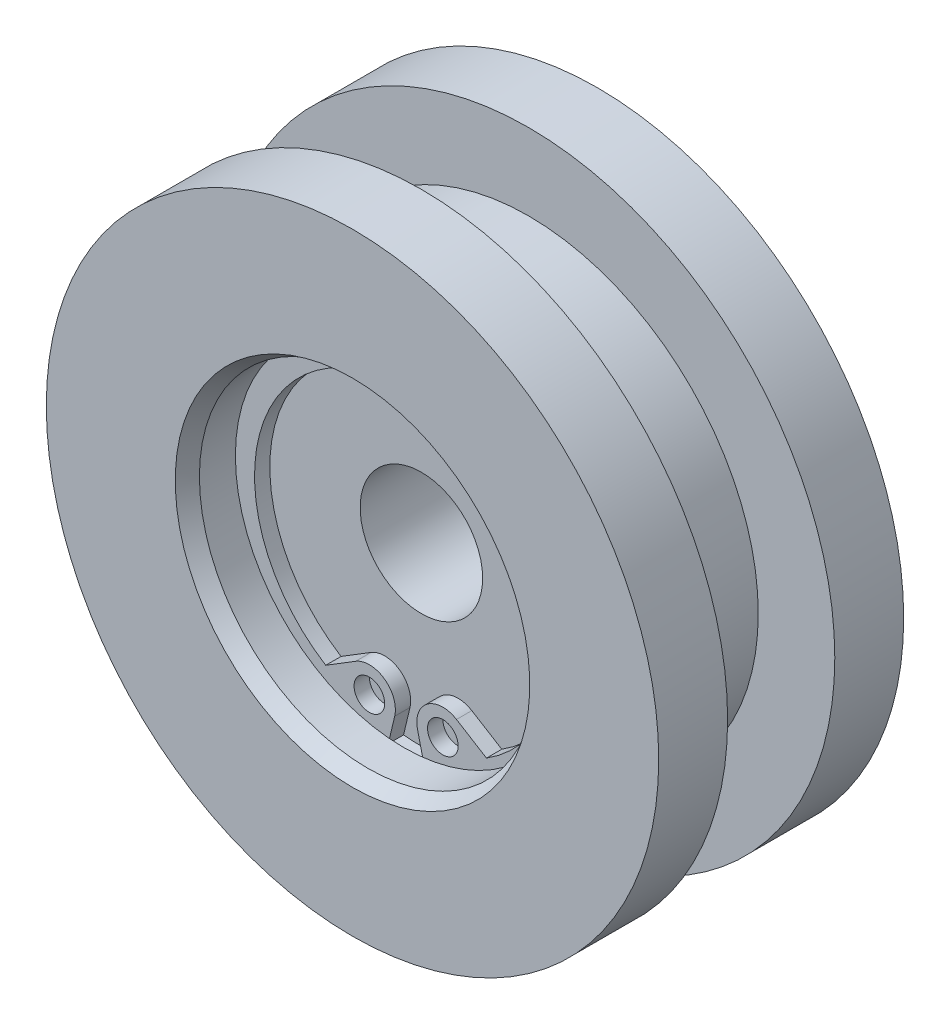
ISO-10303-21;
HEADER;
FILE_DESCRIPTION(('STEP AP214'),'2;1');
FILE_NAME('part.step','',(''),(''),'','','');
FILE_SCHEMA(('AUTOMOTIVE_DESIGN { 1 0 10303 214 1 1 1 1 }'));
ENDSEC;
DATA;
#1=APPLICATION_CONTEXT('core data for automotive mechanical design processes');
#2=APPLICATION_PROTOCOL_DEFINITION('international standard','automotive_design',2000,#1);
#3=PRODUCT_CONTEXT('',#1,'mechanical');
#4=PRODUCT('Part','Part','',(#3));
#5=PRODUCT_RELATED_PRODUCT_CATEGORY('part','',(#4));
#6=PRODUCT_DEFINITION_FORMATION('','',#4);
#7=PRODUCT_DEFINITION_CONTEXT('part definition',#1,'design');
#8=PRODUCT_DEFINITION('design','',#6,#7);
#9=PRODUCT_DEFINITION_SHAPE('','',#8);
#10=(LENGTH_UNIT() NAMED_UNIT(*) SI_UNIT(.MILLI.,.METRE.));
#11=(NAMED_UNIT(*) PLANE_ANGLE_UNIT() SI_UNIT($,.RADIAN.));
#12=(NAMED_UNIT(*) SI_UNIT($,.STERADIAN.) SOLID_ANGLE_UNIT());
#13=UNCERTAINTY_MEASURE_WITH_UNIT(LENGTH_MEASURE(1.E-05),#10,'distance_accuracy_value','');
#14=(GEOMETRIC_REPRESENTATION_CONTEXT(3) GLOBAL_UNCERTAINTY_ASSIGNED_CONTEXT((#13)) GLOBAL_UNIT_ASSIGNED_CONTEXT((#10,
#11,#12)) REPRESENTATION_CONTEXT('',''));
#15=CARTESIAN_POINT('',(0.,0.,0.));
#16=DIRECTION('',(0.,0.,1.));
#17=DIRECTION('',(1.,0.,0.));
#18=AXIS2_PLACEMENT_3D('',#15,#16,#17);
#19=CARTESIAN_POINT('',(0.,0.,-3.5));
#20=DIRECTION('',(0.,0.,1.));
#21=DIRECTION('',(1.,0.,0.));
#22=AXIS2_PLACEMENT_3D('',#19,#20,#21);
#23=CYLINDRICAL_SURFACE('',#22,15.);
#24=CARTESIAN_POINT('',(0.,0.,3.5));
#25=DIRECTION('',(0.,0.,1.));
#26=DIRECTION('',(1.,0.,0.));
#27=AXIS2_PLACEMENT_3D('',#24,#25,#26);
#28=CIRCLE('',#27,15.);
#29=CARTESIAN_POINT('',(15.,0.,3.5));
#30=VERTEX_POINT('',#29);
#31=EDGE_CURVE('E190',#30,#30,#28,.F.);
#32=ORIENTED_EDGE('',*,*,#31,.T.);
#33=EDGE_LOOP('',(#32));
#34=FACE_BOUND('',#33,.T.);
#35=CARTESIAN_POINT('',(0.,0.,-3.5));
#36=DIRECTION('',(0.,0.,1.));
#37=DIRECTION('',(1.,0.,0.));
#38=AXIS2_PLACEMENT_3D('',#35,#36,#37);
#39=CIRCLE('',#38,15.);
#40=CARTESIAN_POINT('',(15.,0.,-3.5));
#41=VERTEX_POINT('',#40);
#42=EDGE_CURVE('E132',#41,#41,#39,.T.);
#43=ORIENTED_EDGE('',*,*,#42,.T.);
#44=EDGE_LOOP('',(#43));
#45=FACE_BOUND('',#44,.T.);
#46=ADVANCED_FACE('F14',(#34,#45),#23,.T.);
#47=CARTESIAN_POINT('',(20.24,-20.309645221,-3.5));
#48=DIRECTION('',(0.,0.,-1.));
#49=DIRECTION('',(-1.,0.,0.));
#50=AXIS2_PLACEMENT_3D('',#47,#48,#49);
#51=PLANE('',#50);
#52=ORIENTED_EDGE('',*,*,#42,.F.);
#53=EDGE_LOOP('',(#52));
#54=FACE_BOUND('',#53,.T.);
#55=CARTESIAN_POINT('',(0.,0.,-3.5));
#56=DIRECTION('',(0.,0.,1.));
#57=DIRECTION('',(1.,0.,0.));
#58=AXIS2_PLACEMENT_3D('',#55,#56,#57);
#59=CIRCLE('',#58,20.);
#60=CARTESIAN_POINT('',(20.,0.,-3.5));
#61=VERTEX_POINT('',#60);
#62=EDGE_CURVE('E193',#61,#61,#59,.F.);
#63=ORIENTED_EDGE('',*,*,#62,.F.);
#64=EDGE_LOOP('',(#63));
#65=FACE_BOUND('',#64,.T.);
#66=ADVANCED_FACE('F249',(#54,#65),#51,.F.);
#67=CARTESIAN_POINT('',(-20.24,-20.309645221,3.5));
#68=DIRECTION('',(0.,0.,1.));
#69=DIRECTION('',(1.,0.,0.));
#70=AXIS2_PLACEMENT_3D('',#67,#68,#69);
#71=PLANE('',#70);
#72=ORIENTED_EDGE('',*,*,#31,.F.);
#73=EDGE_LOOP('',(#72));
#74=FACE_BOUND('',#73,.T.);
#75=CARTESIAN_POINT('',(0.,0.,3.5));
#76=DIRECTION('',(0.,0.,1.));
#77=DIRECTION('',(1.,0.,0.));
#78=AXIS2_PLACEMENT_3D('',#75,#76,#77);
#79=CIRCLE('',#78,20.);
#80=CARTESIAN_POINT('',(20.,0.,3.5));
#81=VERTEX_POINT('',#80);
#82=EDGE_CURVE('E196',#81,#81,#79,.T.);
#83=ORIENTED_EDGE('',*,*,#82,.F.);
#84=EDGE_LOOP('',(#83));
#85=FACE_BOUND('',#84,.T.);
#86=ADVANCED_FACE('F254',(#74,#85),#71,.F.);
#87=CARTESIAN_POINT('',(0.,0.,-8.));
#88=DIRECTION('',(0.,0.,1.));
#89=DIRECTION('',(1.,0.,0.));
#90=AXIS2_PLACEMENT_3D('',#87,#88,#89);
#91=CYLINDRICAL_SURFACE('',#90,20.);
#92=ORIENTED_EDGE('',*,*,#62,.T.);
#93=EDGE_LOOP('',(#92));
#94=FACE_BOUND('',#93,.T.);
#95=CARTESIAN_POINT('',(0.,0.,-8.));
#96=DIRECTION('',(0.,0.,1.));
#97=DIRECTION('',(1.,0.,0.));
#98=AXIS2_PLACEMENT_3D('',#95,#96,#97);
#99=CIRCLE('',#98,20.);
#100=CARTESIAN_POINT('',(20.,0.,-8.));
#101=VERTEX_POINT('',#100);
#102=EDGE_CURVE('E199',#101,#101,#99,.T.);
#103=ORIENTED_EDGE('',*,*,#102,.T.);
#104=EDGE_LOOP('',(#103));
#105=FACE_BOUND('',#104,.T.);
#106=ADVANCED_FACE('F259',(#94,#105),#91,.T.);
#107=CARTESIAN_POINT('',(0.,0.,3.5));
#108=DIRECTION('',(0.,0.,1.));
#109=DIRECTION('',(1.,0.,0.));
#110=AXIS2_PLACEMENT_3D('',#107,#108,#109);
#111=CYLINDRICAL_SURFACE('',#110,20.);
#112=CARTESIAN_POINT('',(0.,0.,8.));
#113=DIRECTION('',(0.,0.,1.));
#114=DIRECTION('',(1.,0.,0.));
#115=AXIS2_PLACEMENT_3D('',#112,#113,#114);
#116=CIRCLE('',#115,20.);
#117=CARTESIAN_POINT('',(20.,0.,8.));
#118=VERTEX_POINT('',#117);
#119=EDGE_CURVE('E202',#118,#118,#116,.F.);
#120=ORIENTED_EDGE('',*,*,#119,.T.);
#121=EDGE_LOOP('',(#120));
#122=FACE_BOUND('',#121,.T.);
#123=ORIENTED_EDGE('',*,*,#82,.T.);
#124=EDGE_LOOP('',(#123));
#125=FACE_BOUND('',#124,.T.);
#126=ADVANCED_FACE('F262',(#122,#125),#111,.T.);
#127=CARTESIAN_POINT('',(-20.24,-20.309645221,-8.));
#128=DIRECTION('',(0.,0.,1.));
#129=DIRECTION('',(1.,0.,0.));
#130=AXIS2_PLACEMENT_3D('',#127,#128,#129);
#131=PLANE('',#130);
#132=CARTESIAN_POINT('',(0.,0.,-8.));
#133=DIRECTION('',(0.,0.,1.));
#134=DIRECTION('',(1.,0.,0.));
#135=AXIS2_PLACEMENT_3D('',#132,#133,#134);
#136=CIRCLE('',#135,9.);
#137=CARTESIAN_POINT('',(9.,0.,-8.));
#138=VERTEX_POINT('',#137);
#139=EDGE_CURVE('E205',#138,#138,#136,.T.);
#140=ORIENTED_EDGE('',*,*,#139,.T.);
#141=EDGE_LOOP('',(#140));
#142=FACE_BOUND('',#141,.T.);
#143=ORIENTED_EDGE('',*,*,#102,.F.);
#144=EDGE_LOOP('',(#143));
#145=FACE_BOUND('',#144,.T.);
#146=ADVANCED_FACE('F266',(#142,#145),#131,.F.);
#147=CARTESIAN_POINT('',(20.24,-20.309645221,8.));
#148=DIRECTION('',(0.,0.,-1.));
#149=DIRECTION('',(-1.,0.,0.));
#150=AXIS2_PLACEMENT_3D('',#147,#148,#149);
#151=PLANE('',#150);
#152=CARTESIAN_POINT('',(0.,0.,8.));
#153=DIRECTION('',(0.,0.,1.));
#154=DIRECTION('',(0.,-1.,0.));
#155=AXIS2_PLACEMENT_3D('',#152,#153,#154);
#156=CIRCLE('',#155,11.577350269);
#157=CARTESIAN_POINT('',(0.,-11.577350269,8.));
#158=VERTEX_POINT('',#157);
#159=EDGE_CURVE('E208',#158,#158,#156,.F.);
#160=ORIENTED_EDGE('',*,*,#159,.T.);
#161=EDGE_LOOP('',(#160));
#162=FACE_BOUND('',#161,.T.);
#163=ORIENTED_EDGE('',*,*,#119,.F.);
#164=EDGE_LOOP('',(#163));
#165=FACE_BOUND('',#164,.T.);
#166=ADVANCED_FACE('F272',(#162,#165),#151,.F.);
#167=CARTESIAN_POINT('',(0.,0.,-8.));
#168=DIRECTION('',(0.,0.,1.));
#169=DIRECTION('',(1.,0.,0.));
#170=AXIS2_PLACEMENT_3D('',#167,#168,#169);
#171=CYLINDRICAL_SURFACE('',#170,9.);
#172=ORIENTED_EDGE('',*,*,#139,.F.);
#173=EDGE_LOOP('',(#172));
#174=FACE_BOUND('',#173,.T.);
#175=CARTESIAN_POINT('',(0.,0.,-3.5));
#176=DIRECTION('',(0.,0.,1.));
#177=DIRECTION('',(1.,0.,0.));
#178=AXIS2_PLACEMENT_3D('',#175,#176,#177);
#179=CIRCLE('',#178,9.);
#180=CARTESIAN_POINT('',(9.,0.,-3.5));
#181=VERTEX_POINT('',#180);
#182=EDGE_CURVE('E211',#181,#181,#179,.T.);
#183=ORIENTED_EDGE('',*,*,#182,.T.);
#184=EDGE_LOOP('',(#183));
#185=FACE_BOUND('',#184,.T.);
#186=ADVANCED_FACE('F268',(#174,#185),#171,.F.);
#187=CARTESIAN_POINT('',(0.,0.,7.));
#188=DIRECTION('',(0.,0.,1.));
#189=DIRECTION('',(0.,-1.,0.));
#190=AXIS2_PLACEMENT_3D('',#187,#188,#189);
#191=CONICAL_SURFACE('',#190,11.,0.523598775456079);
#192=CARTESIAN_POINT('',(0.,0.,7.));
#193=DIRECTION('',(0.,0.,1.));
#194=DIRECTION('',(1.,0.,0.));
#195=AXIS2_PLACEMENT_3D('',#192,#193,#194);
#196=CIRCLE('',#195,11.);
#197=CARTESIAN_POINT('',(11.,0.,7.));
#198=VERTEX_POINT('',#197);
#199=EDGE_CURVE('E214',#198,#198,#196,.F.);
#200=ORIENTED_EDGE('',*,*,#199,.T.);
#201=EDGE_LOOP('',(#200));
#202=FACE_BOUND('',#201,.T.);
#203=ORIENTED_EDGE('',*,*,#159,.F.);
#204=EDGE_LOOP('',(#203));
#205=FACE_BOUND('',#204,.T.);
#206=ADVANCED_FACE('F271',(#202,#205),#191,.F.);
#207=CARTESIAN_POINT('',(-9.108,-9.139340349,-3.5));
#208=DIRECTION('',(0.,0.,1.));
#209=DIRECTION('',(1.,0.,0.));
#210=AXIS2_PLACEMENT_3D('',#207,#208,#209);
#211=PLANE('',#210);
#212=CARTESIAN_POINT('',(0.,0.,-3.5));
#213=DIRECTION('',(0.,0.,1.));
#214=DIRECTION('',(1.,0.,0.));
#215=AXIS2_PLACEMENT_3D('',#212,#213,#214);
#216=CIRCLE('',#215,4.);
#217=CARTESIAN_POINT('',(4.,0.,-3.5));
#218=VERTEX_POINT('',#217);
#219=EDGE_CURVE('E215',#218,#218,#216,.T.);
#220=ORIENTED_EDGE('',*,*,#219,.T.);
#221=EDGE_LOOP('',(#220));
#222=FACE_BOUND('',#221,.T.);
#223=ORIENTED_EDGE('',*,*,#182,.F.);
#224=EDGE_LOOP('',(#223));
#225=FACE_BOUND('',#224,.T.);
#226=ADVANCED_FACE('F276',(#222,#225),#211,.F.);
#227=CARTESIAN_POINT('',(0.,0.,4.85));
#228=DIRECTION('',(0.,0.,1.));
#229=DIRECTION('',(0.,-1.,0.));
#230=AXIS2_PLACEMENT_3D('',#227,#228,#229);
#231=CYLINDRICAL_SURFACE('',#230,11.);
#232=ORIENTED_EDGE('',*,*,#199,.F.);
#233=EDGE_LOOP('',(#232));
#234=FACE_BOUND('',#233,.T.);
#235=CARTESIAN_POINT('',(0.,0.,4.65));
#236=DIRECTION('',(0.,0.,-1.));
#237=DIRECTION('',(-1.,0.,0.));
#238=AXIS2_PLACEMENT_3D('',#235,#236,#237);
#239=CIRCLE('',#238,11.);
#240=CARTESIAN_POINT('',(-11.,0.,4.65));
#241=VERTEX_POINT('',#240);
#242=EDGE_CURVE('E115',#241,#241,#239,.T.);
#243=ORIENTED_EDGE('',*,*,#242,.T.);
#244=EDGE_LOOP('',(#243));
#245=FACE_BOUND('',#244,.T.);
#246=ADVANCED_FACE('F227',(#234,#245),#231,.F.);
#247=CARTESIAN_POINT('',(0.,0.,-3.5));
#248=DIRECTION('',(0.,0.,1.));
#249=DIRECTION('',(1.,0.,0.));
#250=AXIS2_PLACEMENT_3D('',#247,#248,#249);
#251=CYLINDRICAL_SURFACE('',#250,4.);
#252=ORIENTED_EDGE('',*,*,#219,.F.);
#253=EDGE_LOOP('',(#252));
#254=FACE_BOUND('',#253,.T.);
#255=CARTESIAN_POINT('',(0.,0.,3.5));
#256=DIRECTION('',(0.,0.,1.));
#257=DIRECTION('',(1.,0.,0.));
#258=AXIS2_PLACEMENT_3D('',#255,#256,#257);
#259=CIRCLE('',#258,4.);
#260=CARTESIAN_POINT('',(4.,0.,3.5));
#261=VERTEX_POINT('',#260);
#262=EDGE_CURVE('E218',#261,#261,#259,.T.);
#263=ORIENTED_EDGE('',*,*,#262,.T.);
#264=EDGE_LOOP('',(#263));
#265=FACE_BOUND('',#264,.T.);
#266=ADVANCED_FACE('F280',(#254,#265),#251,.F.);
#267=CARTESIAN_POINT('',(11.638,-11.678046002,3.5));
#268=DIRECTION('',(0.,0.,-1.));
#269=DIRECTION('',(-1.,0.,0.));
#270=AXIS2_PLACEMENT_3D('',#267,#268,#269);
#271=PLANE('',#270);
#272=ORIENTED_EDGE('',*,*,#262,.F.);
#273=EDGE_LOOP('',(#272));
#274=FACE_BOUND('',#273,.T.);
#275=DIRECTION('',(0.231349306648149,-0.972870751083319,0.));
#276=VECTOR('',#275,1.);
#277=CARTESIAN_POINT('',(1.77891273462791,-14.0225434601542,3.5));
#278=LINE('',#277,#276);
#279=CARTESIAN_POINT('',(0.746119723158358,-9.67943940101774,3.5));
#280=VERTEX_POINT('',#279);
#281=CARTESIAN_POINT('',(1.16498191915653,-11.440839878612,3.5));
#282=VERTEX_POINT('',#281);
#283=EDGE_CURVE('E23',#280,#282,#278,.T.);
#284=ORIENTED_EDGE('',*,*,#283,.F.);
#285=CARTESIAN_POINT('',(2.4,-9.28614557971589,3.5));
#286=DIRECTION('',(0.,0.,-1.));
#287=DIRECTION('',(-1.,0.,0.));
#288=AXIS2_PLACEMENT_3D('',#285,#286,#287);
#289=CIRCLE('',#288,1.7);
#290=CARTESIAN_POINT('',(3.29136923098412,-7.83857489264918,3.5));
#291=VERTEX_POINT('',#290);
#292=EDGE_CURVE('E154',#280,#291,#289,.T.);
#293=ORIENTED_EDGE('',*,*,#292,.T.);
#294=DIRECTION('',(-0.851512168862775,0.524334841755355,0.));
#295=VECTOR('',#294,1.);
#296=CARTESIAN_POINT('',(11.0575230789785,-12.6207320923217,3.5));
#297=LINE('',#296,#295);
#298=CARTESIAN_POINT('',(5.24892182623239,-9.04397520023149,3.5));
#299=VERTEX_POINT('',#298);
#300=EDGE_CURVE('E157',#299,#291,#297,.T.);
#301=ORIENTED_EDGE('',*,*,#300,.F.);
#302=CARTESIAN_POINT('',(0.,-0.65,3.5));
#303=DIRECTION('',(0.,0.,-1.));
#304=DIRECTION('',(-1.,0.,0.));
#305=AXIS2_PLACEMENT_3D('',#302,#303,#304);
#306=CIRCLE('',#305,9.9);
#307=CARTESIAN_POINT('',(-5.24892182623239,-9.04397520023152,3.5));
#308=VERTEX_POINT('',#307);
#309=EDGE_CURVE('E160',#308,#299,#306,.T.);
#310=ORIENTED_EDGE('',*,*,#309,.F.);
#311=DIRECTION('',(-0.851512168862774,-0.524334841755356,0.));
#312=VECTOR('',#311,1.);
#313=CARTESIAN_POINT('',(5.81927545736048,-2.22852184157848,3.5));
#314=LINE('',#313,#312);
#315=CARTESIAN_POINT('',(-3.29136923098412,-7.83857489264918,3.5));
#316=VERTEX_POINT('',#315);
#317=EDGE_CURVE('E164',#316,#308,#314,.T.);
#318=ORIENTED_EDGE('',*,*,#317,.F.);
#319=CARTESIAN_POINT('',(-2.4,-9.28614557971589,3.5));
#320=DIRECTION('',(0.,0.,-1.));
#321=DIRECTION('',(-1.,0.,0.));
#322=AXIS2_PLACEMENT_3D('',#319,#320,#321);
#323=CIRCLE('',#322,1.7);
#324=CARTESIAN_POINT('',(-0.746119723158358,-9.67943940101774,3.5));
#325=VERTEX_POINT('',#324);
#326=EDGE_CURVE('E169',#316,#325,#323,.T.);
#327=ORIENTED_EDGE('',*,*,#326,.T.);
#328=DIRECTION('',(0.231349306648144,0.97287075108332,0.));
#329=VECTOR('',#328,1.);
#330=CARTESIAN_POINT('',(-0.533122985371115,-8.78374492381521,3.5));
#331=LINE('',#330,#329);
#332=CARTESIAN_POINT('',(-1.16498191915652,-11.440839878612,3.5));
#333=VERTEX_POINT('',#332);
#334=EDGE_CURVE('E104',#333,#325,#331,.T.);
#335=ORIENTED_EDGE('',*,*,#334,.F.);
#336=CARTESIAN_POINT('',(0.,0.,3.5));
#337=DIRECTION('',(0.,0.,1.));
#338=DIRECTION('',(1.,0.,0.));
#339=AXIS2_PLACEMENT_3D('',#336,#337,#338);
#340=CIRCLE('',#339,11.5);
#341=EDGE_CURVE('E187',#333,#282,#340,.T.);
#342=ORIENTED_EDGE('',*,*,#341,.T.);
#343=EDGE_LOOP('',(#284,#293,#301,#310,#318,#327,#335,#342));
#344=FACE_BOUND('',#343,.T.);
#345=ADVANCED_FACE('F247',(#274,#344),#271,.F.);
#346=CARTESIAN_POINT('',(0.,0.,3.5));
#347=DIRECTION('',(0.,0.,1.));
#348=DIRECTION('',(1.,0.,0.));
#349=AXIS2_PLACEMENT_3D('',#346,#347,#348);
#350=CYLINDRICAL_SURFACE('',#349,11.5);
#351=CARTESIAN_POINT('',(0.,0.,4.65));
#352=DIRECTION('',(0.,0.,-1.));
#353=DIRECTION('',(-1.,0.,0.));
#354=AXIS2_PLACEMENT_3D('',#351,#352,#353);
#355=CIRCLE('',#354,11.5);
#356=CARTESIAN_POINT('',(-11.5,0.,4.65));
#357=VERTEX_POINT('',#356);
#358=EDGE_CURVE('E9',#357,#357,#355,.T.);
#359=ORIENTED_EDGE('',*,*,#358,.F.);
#360=EDGE_LOOP('',(#359));
#361=FACE_BOUND('',#360,.T.);
#362=CARTESIAN_POINT('',(0.,0.,4.5));
#363=DIRECTION('',(0.,0.,-1.));
#364=DIRECTION('',(-1.,0.,0.));
#365=AXIS2_PLACEMENT_3D('',#362,#363,#364);
#366=CIRCLE('',#365,11.5);
#367=CARTESIAN_POINT('',(-1.16498191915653,-11.440839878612,4.5));
#368=VERTEX_POINT('',#367);
#369=CARTESIAN_POINT('',(1.16498191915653,-11.440839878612,4.5));
#370=VERTEX_POINT('',#369);
#371=EDGE_CURVE('E83',#368,#370,#366,.T.);
#372=ORIENTED_EDGE('',*,*,#371,.T.);
#373=DIRECTION('',(0.,0.,1.));
#374=VECTOR('',#373,1.);
#375=CARTESIAN_POINT('',(1.16498191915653,-11.440839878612,3.5));
#376=LINE('',#375,#374);
#377=EDGE_CURVE('E180',#370,#282,#376,.F.);
#378=ORIENTED_EDGE('',*,*,#377,.T.);
#379=ORIENTED_EDGE('',*,*,#341,.F.);
#380=DIRECTION('',(0.,0.,1.));
#381=VECTOR('',#380,1.);
#382=CARTESIAN_POINT('',(-1.16498191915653,-11.440839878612,3.5));
#383=LINE('',#382,#381);
#384=EDGE_CURVE('E184',#333,#368,#383,.T.);
#385=ORIENTED_EDGE('',*,*,#384,.T.);
#386=EDGE_LOOP('',(#372,#378,#379,#385));
#387=FACE_BOUND('',#386,.T.);
#388=ADVANCED_FACE('F285',(#361,#387),#350,.F.);
#389=CARTESIAN_POINT('',(2.4,-9.28614557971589,3.5));
#390=DIRECTION('',(0.,0.,-1.));
#391=DIRECTION('',(-1.,0.,0.));
#392=AXIS2_PLACEMENT_3D('',#389,#390,#391);
#393=CIRCLE('',#392,1.);
#394=CARTESIAN_POINT('',(1.4,-9.28614557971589,3.5));
#395=VERTEX_POINT('',#394);
#396=EDGE_CURVE('E177',#395,#395,#393,.T.);
#397=ORIENTED_EDGE('',*,*,#396,.F.);
#398=EDGE_LOOP('',(#397));
#399=FACE_BOUND('',#398,.T.);
#400=ADVANCED_FACE('F244',(#399),#271,.F.);
#401=CARTESIAN_POINT('',(-2.4,-9.28614557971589,3.5));
#402=DIRECTION('',(0.,0.,-1.));
#403=DIRECTION('',(-1.,0.,0.));
#404=AXIS2_PLACEMENT_3D('',#401,#402,#403);
#405=CIRCLE('',#404,1.);
#406=CARTESIAN_POINT('',(-3.4,-9.28614557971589,3.5));
#407=VERTEX_POINT('',#406);
#408=EDGE_CURVE('E173',#407,#407,#405,.T.);
#409=ORIENTED_EDGE('',*,*,#408,.F.);
#410=EDGE_LOOP('',(#409));
#411=FACE_BOUND('',#410,.T.);
#412=ADVANCED_FACE('F234',(#411),#271,.F.);
#413=CARTESIAN_POINT('',(3.29136923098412,-7.83857489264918,4.5));
#414=DIRECTION('',(-0.524334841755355,-0.851512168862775,0.));
#415=DIRECTION('',(-0.851512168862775,0.524334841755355,0.));
#416=AXIS2_PLACEMENT_3D('',#413,#414,#415);
#417=PLANE('',#416);
#418=ORIENTED_EDGE('',*,*,#300,.T.);
#419=DIRECTION('',(0.,0.,-1.));
#420=VECTOR('',#419,1.);
#421=CARTESIAN_POINT('',(3.29136923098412,-7.83857489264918,4.5));
#422=LINE('',#421,#420);
#423=CARTESIAN_POINT('',(3.29136923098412,-7.83857489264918,4.5));
#424=VERTEX_POINT('',#423);
#425=EDGE_CURVE('E112',#424,#291,#422,.T.);
#426=ORIENTED_EDGE('',*,*,#425,.F.);
#427=DIRECTION('',(-0.851512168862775,0.524334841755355,0.));
#428=VECTOR('',#427,1.);
#429=CARTESIAN_POINT('',(3.29136923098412,-7.83857489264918,4.5));
#430=LINE('',#429,#428);
#431=CARTESIAN_POINT('',(5.2489218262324,-9.04397520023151,4.5));
#432=VERTEX_POINT('',#431);
#433=EDGE_CURVE('E119',#432,#424,#430,.T.);
#434=ORIENTED_EDGE('',*,*,#433,.F.);
#435=DIRECTION('',(0.,0.,-1.));
#436=VECTOR('',#435,1.);
#437=CARTESIAN_POINT('',(5.2489218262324,-9.04397520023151,4.5));
#438=LINE('',#437,#436);
#439=EDGE_CURVE('E136',#432,#299,#438,.T.);
#440=ORIENTED_EDGE('',*,*,#439,.T.);
#441=EDGE_LOOP('',(#418,#426,#434,#440));
#442=FACE_BOUND('',#441,.T.);
#443=ADVANCED_FACE('F243',(#442),#417,.F.);
#444=CARTESIAN_POINT('',(0.,-0.65,4.5));
#445=DIRECTION('',(0.,0.,1.));
#446=DIRECTION('',(-1.,0.,0.));
#447=AXIS2_PLACEMENT_3D('',#444,#445,#446);
#448=CYLINDRICAL_SURFACE('',#447,9.9);
#449=ORIENTED_EDGE('',*,*,#309,.T.);
#450=ORIENTED_EDGE('',*,*,#439,.F.);
#451=CARTESIAN_POINT('',(0.,-0.65,4.5));
#452=DIRECTION('',(0.,0.,-1.));
#453=DIRECTION('',(0.,-1.,0.));
#454=AXIS2_PLACEMENT_3D('',#451,#452,#453);
#455=CIRCLE('',#454,9.9);
#456=CARTESIAN_POINT('',(-5.24892182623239,-9.04397520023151,4.5));
#457=VERTEX_POINT('',#456);
#458=EDGE_CURVE('E126',#457,#432,#455,.T.);
#459=ORIENTED_EDGE('',*,*,#458,.F.);
#460=DIRECTION('',(0.,0.,-1.));
#461=VECTOR('',#460,1.);
#462=CARTESIAN_POINT('',(-5.24892182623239,-9.04397520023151,4.5));
#463=LINE('',#462,#461);
#464=EDGE_CURVE('E133',#457,#308,#463,.T.);
#465=ORIENTED_EDGE('',*,*,#464,.T.);
#466=EDGE_LOOP('',(#449,#450,#459,#465));
#467=FACE_BOUND('',#466,.T.);
#468=ADVANCED_FACE('F303',(#467),#448,.F.);
#469=CARTESIAN_POINT('',(-3.29136923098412,-7.83857489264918,4.5));
#470=DIRECTION('',(0.524334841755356,-0.851512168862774,0.));
#471=DIRECTION('',(0.,0.,-1.));
#472=AXIS2_PLACEMENT_3D('',#469,#470,#471);
#473=PLANE('',#472);
#474=ORIENTED_EDGE('',*,*,#317,.T.);
#475=ORIENTED_EDGE('',*,*,#464,.F.);
#476=DIRECTION('',(-0.851512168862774,-0.524334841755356,0.));
#477=VECTOR('',#476,1.);
#478=CARTESIAN_POINT('',(-3.29136923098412,-7.83857489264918,4.5));
#479=LINE('',#478,#477);
#480=CARTESIAN_POINT('',(-3.29136923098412,-7.83857489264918,4.5));
#481=VERTEX_POINT('',#480);
#482=EDGE_CURVE('E129',#481,#457,#479,.T.);
#483=ORIENTED_EDGE('',*,*,#482,.F.);
#484=DIRECTION('',(0.,0.,-1.));
#485=VECTOR('',#484,1.);
#486=CARTESIAN_POINT('',(-3.29136923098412,-7.83857489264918,4.5));
#487=LINE('',#486,#485);
#488=EDGE_CURVE('E97',#481,#316,#487,.T.);
#489=ORIENTED_EDGE('',*,*,#488,.T.);
#490=EDGE_LOOP('',(#474,#475,#483,#489));
#491=FACE_BOUND('',#490,.T.);
#492=ADVANCED_FACE('F16',(#491),#473,.F.);
#493=CARTESIAN_POINT('',(-2.4,-9.28614557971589,4.5));
#494=DIRECTION('',(0.,0.,1.));
#495=DIRECTION('',(-1.,0.,0.));
#496=AXIS2_PLACEMENT_3D('',#493,#494,#495);
#497=CYLINDRICAL_SURFACE('',#496,1.);
#498=ORIENTED_EDGE('',*,*,#408,.T.);
#499=EDGE_LOOP('',(#498));
#500=FACE_BOUND('',#499,.T.);
#501=CARTESIAN_POINT('',(-2.4,-9.28614557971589,4.5));
#502=DIRECTION('',(0.,0.,-1.));
#503=DIRECTION('',(1.,0.,0.));
#504=AXIS2_PLACEMENT_3D('',#501,#502,#503);
#505=CIRCLE('',#504,1.);
#506=CARTESIAN_POINT('',(-1.4,-9.28614557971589,4.5));
#507=VERTEX_POINT('',#506);
#508=EDGE_CURVE('E99',#507,#507,#505,.T.);
#509=ORIENTED_EDGE('',*,*,#508,.F.);
#510=EDGE_LOOP('',(#509));
#511=FACE_BOUND('',#510,.T.);
#512=ADVANCED_FACE('F307',(#500,#511),#497,.F.);
#513=CARTESIAN_POINT('',(2.4,-9.28614557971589,4.5));
#514=DIRECTION('',(0.,0.,1.));
#515=DIRECTION('',(-1.,0.,0.));
#516=AXIS2_PLACEMENT_3D('',#513,#514,#515);
#517=CYLINDRICAL_SURFACE('',#516,1.);
#518=ORIENTED_EDGE('',*,*,#396,.T.);
#519=EDGE_LOOP('',(#518));
#520=FACE_BOUND('',#519,.T.);
#521=CARTESIAN_POINT('',(2.4,-9.28614557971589,4.5));
#522=DIRECTION('',(0.,0.,1.));
#523=DIRECTION('',(1.,0.,0.));
#524=AXIS2_PLACEMENT_3D('',#521,#522,#523);
#525=CIRCLE('',#524,1.);
#526=CARTESIAN_POINT('',(3.4,-9.28614557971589,4.5));
#527=VERTEX_POINT('',#526);
#528=EDGE_CURVE('E107',#527,#527,#525,.T.);
#529=ORIENTED_EDGE('',*,*,#528,.T.);
#530=EDGE_LOOP('',(#529));
#531=FACE_BOUND('',#530,.T.);
#532=ADVANCED_FACE('F310',(#520,#531),#517,.F.);
#533=CARTESIAN_POINT('',(2.4,-9.28614557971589,4.5));
#534=DIRECTION('',(0.,0.,1.));
#535=DIRECTION('',(-1.,0.,0.));
#536=AXIS2_PLACEMENT_3D('',#533,#534,#535);
#537=CYLINDRICAL_SURFACE('',#536,1.7);
#538=ORIENTED_EDGE('',*,*,#292,.F.);
#539=DIRECTION('',(0.,0.,-1.));
#540=VECTOR('',#539,1.);
#541=CARTESIAN_POINT('',(0.746119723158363,-9.67943940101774,4.5));
#542=LINE('',#541,#540);
#543=CARTESIAN_POINT('',(0.746119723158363,-9.67943940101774,4.5));
#544=VERTEX_POINT('',#543);
#545=EDGE_CURVE('E106',#544,#280,#542,.T.);
#546=ORIENTED_EDGE('',*,*,#545,.F.);
#547=CARTESIAN_POINT('',(2.4,-9.28614557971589,4.5));
#548=DIRECTION('',(0.,0.,1.));
#549=DIRECTION('',(1.,0.,0.));
#550=AXIS2_PLACEMENT_3D('',#547,#548,#549);
#551=CIRCLE('',#550,1.7);
#552=EDGE_CURVE('E123',#424,#544,#551,.T.);
#553=ORIENTED_EDGE('',*,*,#552,.F.);
#554=ORIENTED_EDGE('',*,*,#425,.T.);
#555=EDGE_LOOP('',(#538,#546,#553,#554));
#556=FACE_BOUND('',#555,.T.);
#557=ADVANCED_FACE('F240',(#556),#537,.T.);
#558=CARTESIAN_POINT('',(0.,-0.65,4.5));
#559=DIRECTION('',(0.,0.,-1.));
#560=DIRECTION('',(0.,-1.,0.));
#561=AXIS2_PLACEMENT_3D('',#558,#559,#560);
#562=PLANE('',#561);
#563=ORIENTED_EDGE('',*,*,#528,.F.);
#564=EDGE_LOOP('',(#563));
#565=FACE_BOUND('',#564,.T.);
#566=ORIENTED_EDGE('',*,*,#508,.T.);
#567=EDGE_LOOP('',(#566));
#568=FACE_BOUND('',#567,.T.);
#569=ORIENTED_EDGE('',*,*,#371,.F.);
#570=DIRECTION('',(0.231349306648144,0.97287075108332,0.));
#571=VECTOR('',#570,1.);
#572=CARTESIAN_POINT('',(-0.746119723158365,-9.67943940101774,4.5));
#573=LINE('',#572,#571);
#574=CARTESIAN_POINT('',(-0.746119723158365,-9.67943940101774,4.5));
#575=VERTEX_POINT('',#574);
#576=EDGE_CURVE('E77',#368,#575,#573,.T.);
#577=ORIENTED_EDGE('',*,*,#576,.T.);
#578=CARTESIAN_POINT('',(-2.4,-9.28614557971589,4.5));
#579=DIRECTION('',(0.,0.,1.));
#580=DIRECTION('',(-1.,0.,0.));
#581=AXIS2_PLACEMENT_3D('',#578,#579,#580);
#582=CIRCLE('',#581,1.7);
#583=EDGE_CURVE('E80',#575,#481,#582,.T.);
#584=ORIENTED_EDGE('',*,*,#583,.T.);
#585=ORIENTED_EDGE('',*,*,#482,.T.);
#586=ORIENTED_EDGE('',*,*,#458,.T.);
#587=ORIENTED_EDGE('',*,*,#433,.T.);
#588=ORIENTED_EDGE('',*,*,#552,.T.);
#589=DIRECTION('',(0.231349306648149,-0.972870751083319,0.));
#590=VECTOR('',#589,1.);
#591=CARTESIAN_POINT('',(0.746119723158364,-9.67943940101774,4.5));
#592=LINE('',#591,#590);
#593=EDGE_CURVE('E68',#544,#370,#592,.T.);
#594=ORIENTED_EDGE('',*,*,#593,.T.);
#595=EDGE_LOOP('',(#569,#577,#584,#585,#586,#587,#588,#594));
#596=FACE_BOUND('',#595,.T.);
#597=ADVANCED_FACE('F79',(#565,#568,#596),#562,.F.);
#598=CARTESIAN_POINT('',(-2.4,-9.28614557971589,4.5));
#599=DIRECTION('',(0.,0.,1.));
#600=DIRECTION('',(-1.,0.,0.));
#601=AXIS2_PLACEMENT_3D('',#598,#599,#600);
#602=CYLINDRICAL_SURFACE('',#601,1.7);
#603=ORIENTED_EDGE('',*,*,#326,.F.);
#604=ORIENTED_EDGE('',*,*,#488,.F.);
#605=ORIENTED_EDGE('',*,*,#583,.F.);
#606=DIRECTION('',(0.,0.,-1.));
#607=VECTOR('',#606,1.);
#608=CARTESIAN_POINT('',(-0.746119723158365,-9.67943940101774,4.5));
#609=LINE('',#608,#607);
#610=EDGE_CURVE('E95',#575,#325,#609,.T.);
#611=ORIENTED_EDGE('',*,*,#610,.T.);
#612=EDGE_LOOP('',(#603,#604,#605,#611));
#613=FACE_BOUND('',#612,.T.);
#614=ADVANCED_FACE('F93',(#613),#602,.T.);
#615=CARTESIAN_POINT('',(-0.746119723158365,-9.67943940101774,4.5));
#616=DIRECTION('',(-0.97287075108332,0.231349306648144,0.));
#617=DIRECTION('',(0.,0.,1.));
#618=AXIS2_PLACEMENT_3D('',#615,#616,#617);
#619=PLANE('',#618);
#620=ORIENTED_EDGE('',*,*,#384,.F.);
#621=ORIENTED_EDGE('',*,*,#334,.T.);
#622=ORIENTED_EDGE('',*,*,#610,.F.);
#623=ORIENTED_EDGE('',*,*,#576,.F.);
#624=EDGE_LOOP('',(#620,#621,#622,#623));
#625=FACE_BOUND('',#624,.T.);
#626=ADVANCED_FACE('F102',(#625),#619,.F.);
#627=CARTESIAN_POINT('',(0.746119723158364,-9.67943940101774,4.5));
#628=DIRECTION('',(0.972870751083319,0.231349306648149,0.));
#629=DIRECTION('',(0.,0.,-1.));
#630=AXIS2_PLACEMENT_3D('',#627,#628,#629);
#631=PLANE('',#630);
#632=ORIENTED_EDGE('',*,*,#377,.F.);
#633=ORIENTED_EDGE('',*,*,#593,.F.);
#634=ORIENTED_EDGE('',*,*,#545,.T.);
#635=ORIENTED_EDGE('',*,*,#283,.T.);
#636=EDGE_LOOP('',(#632,#633,#634,#635));
#637=FACE_BOUND('',#636,.T.);
#638=ADVANCED_FACE('F231',(#637),#631,.F.);
#639=CARTESIAN_POINT('',(0.,0.,4.65));
#640=DIRECTION('',(0.,0.,-1.));
#641=DIRECTION('',(-1.,0.,0.));
#642=AXIS2_PLACEMENT_3D('',#639,#640,#641);
#643=PLANE('',#642);
#644=ORIENTED_EDGE('',*,*,#358,.T.);
#645=EDGE_LOOP('',(#644));
#646=FACE_BOUND('',#645,.T.);
#647=ORIENTED_EDGE('',*,*,#242,.F.);
#648=EDGE_LOOP('',(#647));
#649=FACE_BOUND('',#648,.T.);
#650=ADVANCED_FACE('F229',(#646,#649),#643,.T.);
#651=CLOSED_SHELL('',(#46,#66,#86,#106,#126,#146,#166,#186,#206,#226,#246,#266,#345,#388,#400,
#412,#443,#468,#492,#512,#532,#557,#597,#614,#626,#638,#650));
#652=MANIFOLD_SOLID_BREP('B1',#651);
#653=ADVANCED_BREP_SHAPE_REPRESENTATION('',(#18,#652),#14);
#654=SHAPE_DEFINITION_REPRESENTATION(#9,#653);
ENDSEC;
END-ISO-10303-21;
